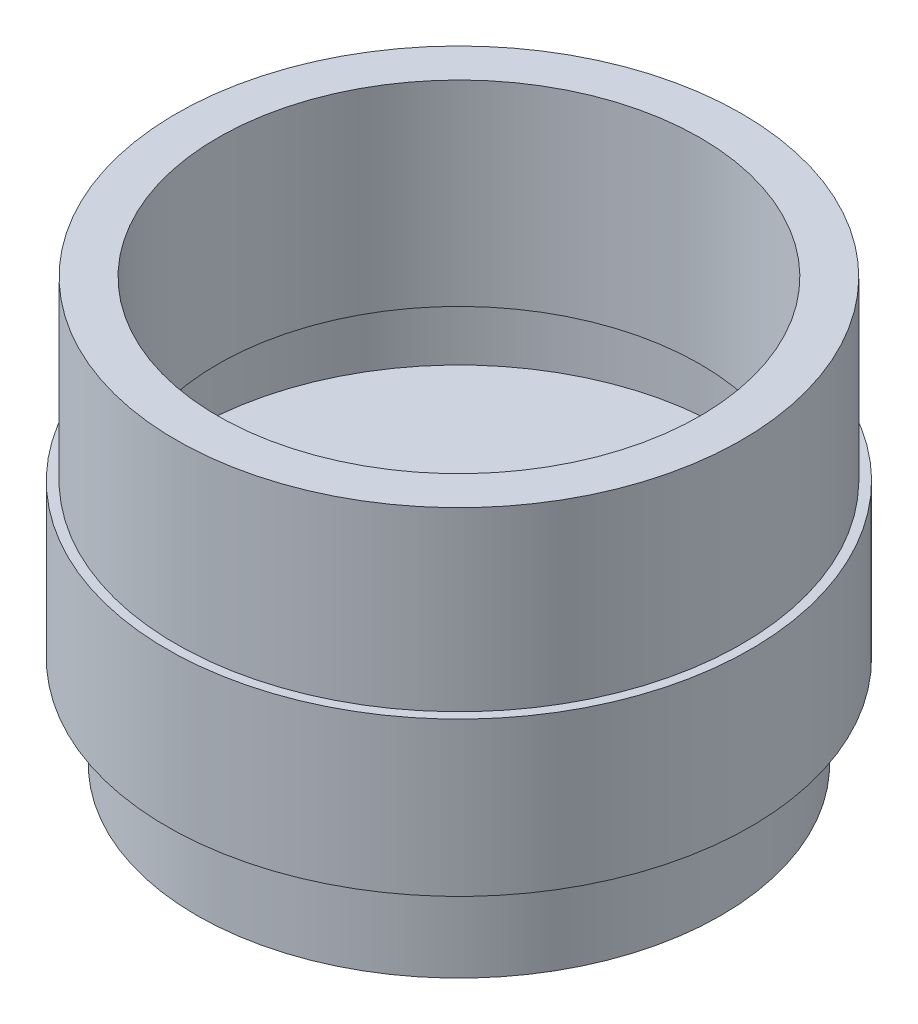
from build123d import *


with BuildPart() as part:
    # Sketch1 → Revolve1 (revolve)
    with BuildSketch(Plane.XY, mode=Mode.PRIVATE) as revolve1_sk:
        Polygon((5.588, 0), (7.9121, 0), (7.9121, 2.7686), (8.80745, 2.7686), (8.80745, 7.4041), (8.5344, 7.4041), (8.5344, 12.7381), (7.2771, 12.7381), (7.2771, 6.8199), (8.02005, 6.8199), (8.02005, 4.7625), (3.93065, 4.7625), (3.93065, 1.65735), align=None)
    revolve(revolve1_sk.sketch.rotate(Axis((0, 0, 0), (0, 1, 0)), 90), axis=Axis((0, 0, 0), (0, 1, 0)))


solid = part.part
